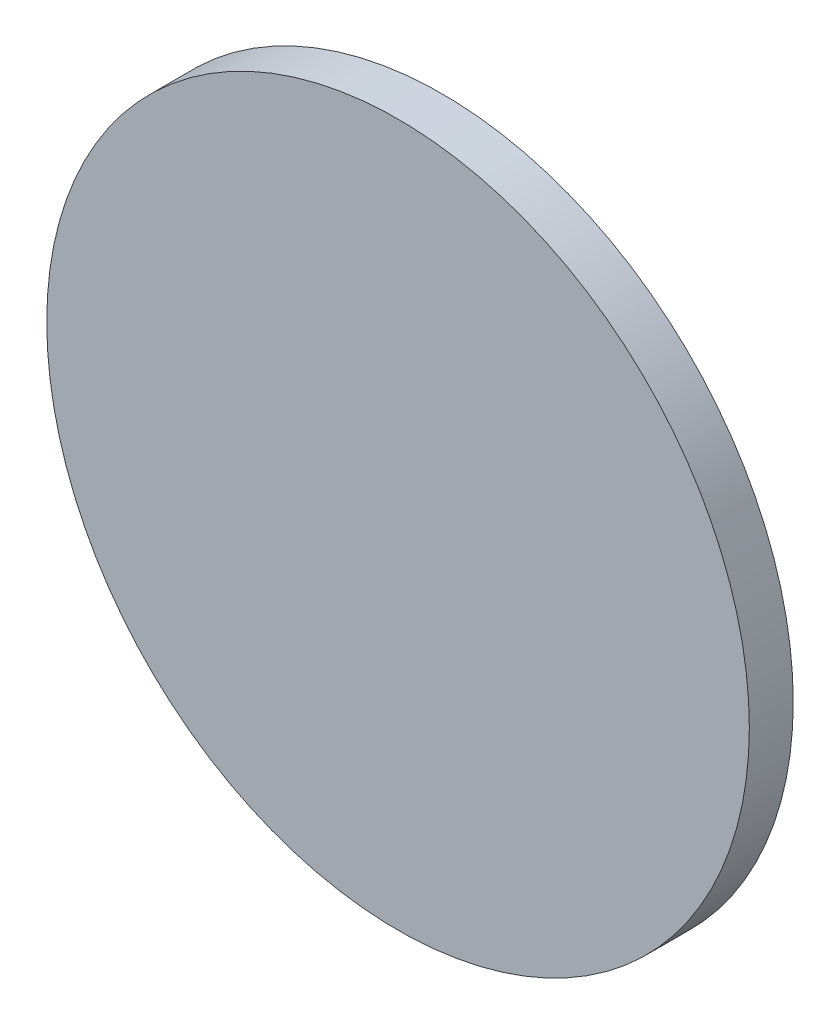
from build123d import *

# Parameters (mm, degrees)
SKETCH1_R           = 25.4
BOSS_EXTRUDE1_DEPTH = 3.175


with BuildPart() as part:
    # Sketch1 → Boss-Extrude1 (new body)
    with BuildSketch(Plane.XY):
        Circle(SKETCH1_R)
    extrude(amount=BOSS_EXTRUDE1_DEPTH)


solid = part.part
